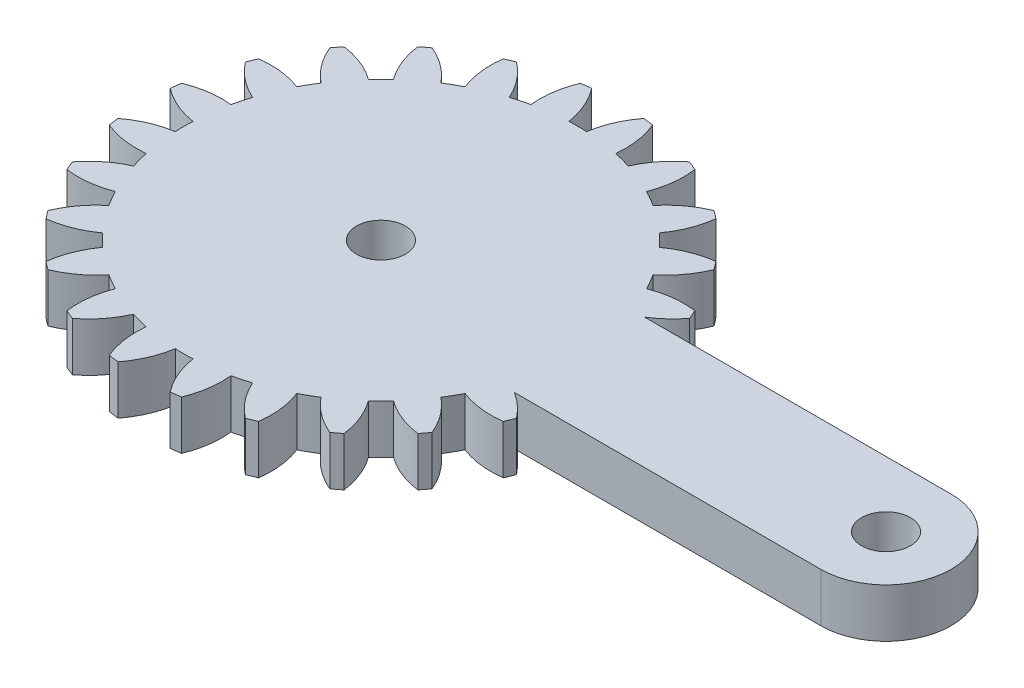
from build123d import *

# Parameters (mm, degrees)
SKETCH1_R           = 1.5
BOSS_EXTRUDE1_DEPTH = 3


with BuildPart() as part:
    # Sketch1 → Boss-Extrude1 (new body)
    with BuildSketch(Plane(origin=(0, 0, 0), x_dir=(1, 0, 0), z_dir=(0, 1, 0))):
        with BuildLine():
            Line((20.893657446, 4), (2.081641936, 4))
            ThreePointArc((2.081641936, 4), (2.861028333, 4.588201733), (3.521749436, 5.30713988))
            ThreePointArc((3.521749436, 5.30713988), (3.405395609, 5.596745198), (3.282888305, 5.883801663))
            ThreePointArc((3.282888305, 5.883801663), (1.93527598, 5.894040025), (0.627094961, 5.57027124))
            ThreePointArc((0.627094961, 5.57027124), (0.366286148, 6.046375), (0.084372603, 6.510293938))
            ThreePointArc((0.084372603, 6.510293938), (1.018855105, 7.48132754), (1.683794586, 8.65351323))
            ThreePointArc((1.683794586, 8.65351323), (1.496450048, 8.903135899), (1.303821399, 9.148703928))
            ThreePointArc((1.303821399, 9.148703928), (-0.000522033, 8.809805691), (-1.180330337, 8.158486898))
            ThreePointArc((-1.180330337, 8.158486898), (-1.555477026, 8.550865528), (-1.947855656, 8.926012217))
            ThreePointArc((-1.947855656, 8.926012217), (-1.296536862, 10.105820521), (-0.957638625, 11.410163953))
            ThreePointArc((-0.957638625, 11.410163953), (-1.203206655, 11.602792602), (-1.452829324, 11.79013714))
            ThreePointArc((-1.452829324, 11.79013714), (-2.625015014, 11.125197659), (-3.596048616, 10.190715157))
            ThreePointArc((-3.596048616, 10.190715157), (-4.059967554, 10.472628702), (-4.536071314, 10.733437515))
            ThreePointArc((-4.536071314, 10.733437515), (-4.212302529, 12.041618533), (-4.222540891, 13.389230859))
            ThreePointArc((-4.222540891, 13.389230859), (-4.509597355, 13.511738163), (-4.799202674, 13.62809199))
            ThreePointArc((-4.799202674, 13.62809199), (-5.759348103, 12.682425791), (-6.455432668, 11.528463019))
            ThreePointArc((-6.455432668, 11.528463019), (-6.976508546, 11.680699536), (-7.503891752, 11.809396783))
            ThreePointArc((-7.503891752, 11.809396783), (-7.529737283, 13.156800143), (-7.888414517, 14.455843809))
            ThreePointArc((-7.888414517, 14.455843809), (-8.197396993, 14.499881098), (-8.507248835, 14.537314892))
            ThreePointArc((-8.507248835, 14.537314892), (-9.18992168, 13.375367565), (-9.563620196, 12.080565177))
            ThreePointArc((-9.563620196, 12.080565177), (-10.106342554, 12.09275), (-10.649064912, 12.080565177))
            ThreePointArc((-10.649064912, 12.080565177), (-11.022763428, 13.375367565), (-11.705436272, 14.537314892))
            ThreePointArc((-11.705436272, 14.537314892), (-12.015288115, 14.499881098), (-12.324270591, 14.455843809))
            ThreePointArc((-12.324270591, 14.455843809), (-12.682947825, 13.156800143), (-12.708793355, 11.809396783))
            ThreePointArc((-12.708793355, 11.809396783), (-13.236176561, 11.680699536), (-13.757252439, 11.528463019))
            ThreePointArc((-13.757252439, 11.528463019), (-14.453337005, 12.682425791), (-15.413482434, 13.62809199))
            ThreePointArc((-15.413482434, 13.62809199), (-15.703087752, 13.511738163), (-15.990144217, 13.389230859))
            ThreePointArc((-15.990144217, 13.389230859), (-16.000382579, 12.041618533), (-15.676613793, 10.733437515))
            ThreePointArc((-15.676613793, 10.733437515), (-16.152717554, 10.472628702), (-16.616636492, 10.190715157))
            ThreePointArc((-16.616636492, 10.190715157), (-17.587670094, 11.125197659), (-18.759855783, 11.79013714))
            ThreePointArc((-18.759855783, 11.79013714), (-19.009478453, 11.602792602), (-19.255046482, 11.410163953))
            ThreePointArc((-19.255046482, 11.410163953), (-18.916148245, 10.105820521), (-18.264829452, 8.926012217))
            ThreePointArc((-18.264829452, 8.926012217), (-18.657208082, 8.550865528), (-19.032354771, 8.158486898))
            ThreePointArc((-19.032354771, 8.158486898), (-20.212163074, 8.809805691), (-21.516506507, 9.148703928))
            ThreePointArc((-21.516506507, 9.148703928), (-21.709135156, 8.903135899), (-21.896479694, 8.65351323))
            ThreePointArc((-21.896479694, 8.65351323), (-21.231540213, 7.48132754), (-20.297057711, 6.510293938))
            ThreePointArc((-20.297057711, 6.510293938), (-20.578971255, 6.046375), (-20.839780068, 5.57027124))
            ThreePointArc((-20.839780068, 5.57027124), (-22.147961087, 5.894040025), (-23.495573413, 5.883801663))
            ThreePointArc((-23.495573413, 5.883801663), (-23.618080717, 5.596745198), (-23.734434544, 5.30713988))
            ThreePointArc((-23.734434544, 5.30713988), (-22.788768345, 4.346994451), (-21.634805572, 3.650909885))
            ThreePointArc((-21.634805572, 3.650909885), (-21.78704209, 3.129834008), (-21.915739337, 2.602450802))
            ThreePointArc((-21.915739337, 2.602450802), (-23.263142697, 2.576605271), (-24.562186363, 2.217928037))
            ThreePointArc((-24.562186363, 2.217928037), (-24.606223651, 1.908945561), (-24.643657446, 1.599093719))
            ThreePointArc((-24.643657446, 1.599093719), (-23.481710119, 0.916420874), (-22.186907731, 0.542722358))
            ThreePointArc((-22.186907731, 0.542722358), (-22.199092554, 0), (-22.186907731, -0.542722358))
            ThreePointArc((-22.186907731, -0.542722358), (-23.481710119, -0.916420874), (-24.643657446, -1.599093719))
            ThreePointArc((-24.643657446, -1.599093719), (-24.606223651, -1.908945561), (-24.562186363, -2.217928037))
            ThreePointArc((-24.562186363, -2.217928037), (-23.263142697, -2.576605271), (-21.915739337, -2.602450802))
            ThreePointArc((-21.915739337, -2.602450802), (-21.78704209, -3.129834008), (-21.634805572, -3.650909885))
            ThreePointArc((-21.634805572, -3.650909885), (-22.788768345, -4.346994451), (-23.734434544, -5.30713988))
            ThreePointArc((-23.734434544, -5.30713988), (-23.618080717, -5.596745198), (-23.495573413, -5.883801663))
            ThreePointArc((-23.495573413, -5.883801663), (-22.147961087, -5.894040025), (-20.839780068, -5.57027124))
            ThreePointArc((-20.839780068, -5.57027124), (-20.578971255, -6.046375), (-20.297057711, -6.510293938))
            ThreePointArc((-20.297057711, -6.510293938), (-21.231540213, -7.48132754), (-21.896479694, -8.65351323))
            ThreePointArc((-21.896479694, -8.65351323), (-21.709135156, -8.903135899), (-21.516506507, -9.148703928))
            ThreePointArc((-21.516506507, -9.148703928), (-20.212163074, -8.809805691), (-19.032354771, -8.158486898))
            ThreePointArc((-19.032354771, -8.158486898), (-18.657208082, -8.550865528), (-18.264829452, -8.926012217))
            ThreePointArc((-18.264829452, -8.926012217), (-18.916148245, -10.105820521), (-19.255046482, -11.410163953))
            ThreePointArc((-19.255046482, -11.410163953), (-19.009478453, -11.602792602), (-18.759855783, -11.79013714))
            ThreePointArc((-18.759855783, -11.79013714), (-17.587670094, -11.125197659), (-16.616636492, -10.190715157))
            ThreePointArc((-16.616636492, -10.190715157), (-16.152717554, -10.472628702), (-15.676613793, -10.733437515))
            ThreePointArc((-15.676613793, -10.733437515), (-16.000382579, -12.041618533), (-15.990144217, -13.389230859))
            ThreePointArc((-15.990144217, -13.389230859), (-15.703087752, -13.511738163), (-15.413482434, -13.62809199))
            ThreePointArc((-15.413482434, -13.62809199), (-14.453337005, -12.682425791), (-13.757252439, -11.528463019))
            ThreePointArc((-13.757252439, -11.528463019), (-13.236176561, -11.680699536), (-12.708793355, -11.809396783))
            ThreePointArc((-12.708793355, -11.809396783), (-12.682947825, -13.156800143), (-12.324270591, -14.455843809))
            ThreePointArc((-12.324270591, -14.455843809), (-12.015288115, -14.499881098), (-11.705436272, -14.537314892))
            ThreePointArc((-11.705436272, -14.537314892), (-11.022763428, -13.375367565), (-10.649064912, -12.080565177))
            ThreePointArc((-10.649064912, -12.080565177), (-10.106342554, -12.09275), (-9.563620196, -12.080565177))
            ThreePointArc((-9.563620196, -12.080565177), (-9.18992168, -13.375367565), (-8.507248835, -14.537314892))
            ThreePointArc((-8.507248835, -14.537314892), (-8.197396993, -14.499881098), (-7.888414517, -14.455843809))
            ThreePointArc((-7.888414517, -14.455843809), (-7.529737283, -13.156800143), (-7.503891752, -11.809396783))
            ThreePointArc((-7.503891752, -11.809396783), (-6.976508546, -11.680699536), (-6.455432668, -11.528463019))
            ThreePointArc((-6.455432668, -11.528463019), (-5.759348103, -12.682425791), (-4.799202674, -13.62809199))
            ThreePointArc((-4.799202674, -13.62809199), (-4.509597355, -13.511738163), (-4.222540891, -13.389230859))
            ThreePointArc((-4.222540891, -13.389230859), (-4.212302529, -12.041618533), (-4.536071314, -10.733437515))
            ThreePointArc((-4.536071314, -10.733437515), (-4.059967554, -10.472628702), (-3.596048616, -10.190715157))
            ThreePointArc((-3.596048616, -10.190715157), (-2.625015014, -11.125197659), (-1.452829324, -11.79013714))
            ThreePointArc((-1.452829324, -11.79013714), (-1.203206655, -11.602792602), (-0.957638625, -11.410163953))
            ThreePointArc((-0.957638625, -11.410163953), (-1.296536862, -10.105820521), (-1.947855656, -8.926012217))
            ThreePointArc((-1.947855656, -8.926012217), (-1.555477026, -8.550865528), (-1.180330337, -8.158486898))
            ThreePointArc((-1.180330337, -8.158486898), (-0.000522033, -8.809805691), (1.303821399, -9.148703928))
            ThreePointArc((1.303821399, -9.148703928), (1.496450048, -8.903135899), (1.683794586, -8.65351323))
            ThreePointArc((1.683794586, -8.65351323), (1.018855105, -7.48132754), (0.084372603, -6.510293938))
            ThreePointArc((0.084372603, -6.510293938), (0.366286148, -6.046375), (0.627094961, -5.57027124))
            ThreePointArc((0.627094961, -5.57027124), (1.93527598, -5.894040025), (3.282888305, -5.883801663))
            ThreePointArc((3.282888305, -5.883801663), (3.405395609, -5.596745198), (3.521749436, -5.30713988))
            ThreePointArc((3.521749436, -5.30713988), (2.861028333, -4.588201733), (2.081641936, -4))
            Line((2.081641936, -4), (20.893657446, -4))
            ThreePointArc((20.893657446, -4), (24.893657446, 0), (20.893657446, 4))
        make_face()
        with Locations(Location((-10.106342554, 0, 0), (0, 0, 270))):
            Circle(SKETCH1_R, mode=Mode.SUBTRACT)
        with Locations(Location((20.893657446, 0, 0), (0, 0, 270))):
            Circle(SKETCH1_R, mode=Mode.SUBTRACT)
    extrude(amount=BOSS_EXTRUDE1_DEPTH)


solid = part.part
